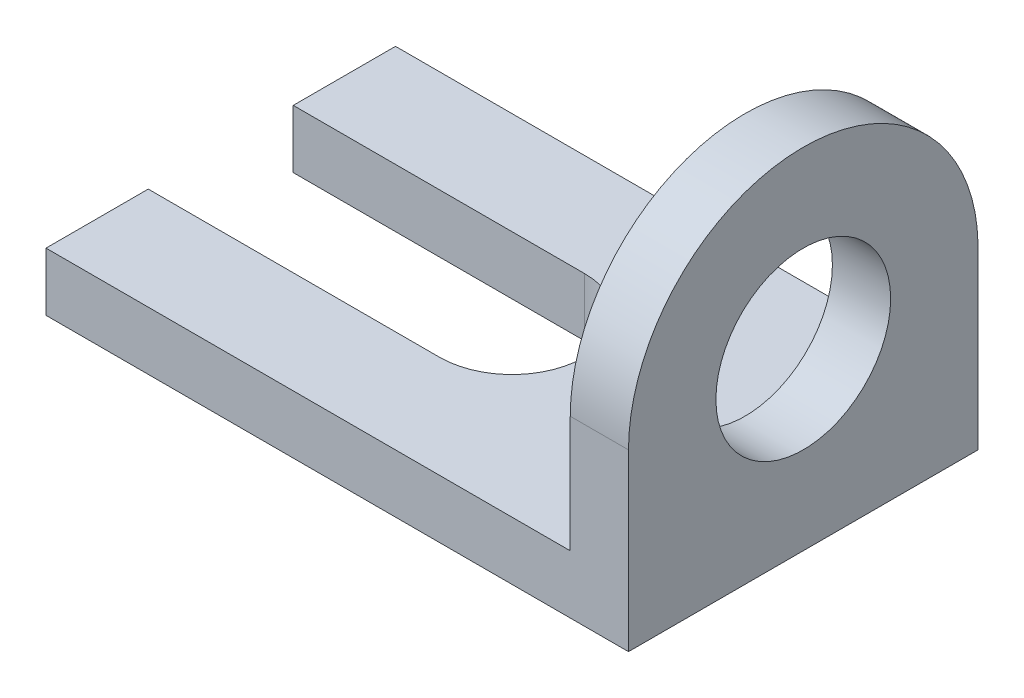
from build123d import *

# Parameters (mm, degrees)
EXTRUDE_1_DEPTH = 10
SKETCH_2_R      = 15
EXTRUDE_2_DEPTH = 10


with BuildPart() as part:
    # Sketch 1 → Extrude 1 (new body)
    with BuildSketch(Plane(origin=(0, 0, 0), x_dir=(1, 0, 0), z_dir=(0, 1, 0))):
        with BuildLine():
            Line((-50, 12.446225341), (0, 12.446225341))
            ThreePointArc((0, 12.446225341), (12.446225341, 0), (0, -12.446225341))
            Line((0, -12.446225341), (-50, -12.446225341))
            Line((-50, -12.446225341), (-50, -30))
            Line((-50, -30), (50, -30))
            Line((50, -30), (50, 30))
            Line((50, 30), (-50, 30))
            Line((-50, 30), (-50, 12.446225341))
        make_face()
    extrude(amount=EXTRUDE_1_DEPTH)

    # Sketch 2 → Extrude 2 (add)
    with BuildSketch(Plane(origin=(50, 0, 0), x_dir=(0, 0, -1), z_dir=(1, 0, 0))):
        with BuildLine():
            Line((-30, 10), (-30, 30))
            ThreePointArc((-30, 30), (-0.376055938, 60.00241748), (30, 30.761720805))
            Line((30, 30.761720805), (30, 10))
            Line((30, 10), (-30, 10))
        make_face()
        with Locations((0.004835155, 30)):
            Circle(SKETCH_2_R, mode=Mode.SUBTRACT)
    extrude(amount=-EXTRUDE_2_DEPTH)


solid = part.part
